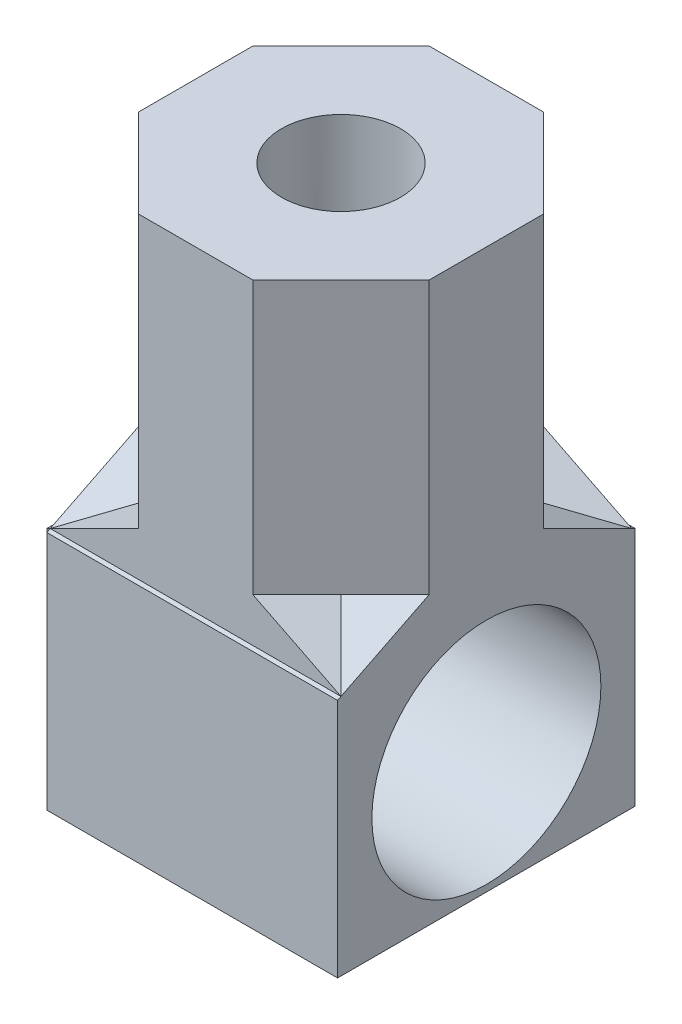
ISO-10303-21;
HEADER;
FILE_DESCRIPTION(('STEP AP214'),'2;1');
FILE_NAME('part.step','',(''),(''),'','','');
FILE_SCHEMA(('AUTOMOTIVE_DESIGN { 1 0 10303 214 1 1 1 1 }'));
ENDSEC;
DATA;
#1=APPLICATION_CONTEXT('core data for automotive mechanical design processes');
#2=APPLICATION_PROTOCOL_DEFINITION('international standard','automotive_design',2000,#1);
#3=PRODUCT_CONTEXT('',#1,'mechanical');
#4=PRODUCT('Part','Part','',(#3));
#5=PRODUCT_RELATED_PRODUCT_CATEGORY('part','',(#4));
#6=PRODUCT_DEFINITION_FORMATION('','',#4);
#7=PRODUCT_DEFINITION_CONTEXT('part definition',#1,'design');
#8=PRODUCT_DEFINITION('design','',#6,#7);
#9=PRODUCT_DEFINITION_SHAPE('','',#8);
#10=(LENGTH_UNIT() NAMED_UNIT(*) SI_UNIT(.MILLI.,.METRE.));
#11=(NAMED_UNIT(*) PLANE_ANGLE_UNIT() SI_UNIT($,.RADIAN.));
#12=(NAMED_UNIT(*) SI_UNIT($,.STERADIAN.) SOLID_ANGLE_UNIT());
#13=UNCERTAINTY_MEASURE_WITH_UNIT(LENGTH_MEASURE(1.E-05),#10,'distance_accuracy_value','');
#14=(GEOMETRIC_REPRESENTATION_CONTEXT(3) GLOBAL_UNCERTAINTY_ASSIGNED_CONTEXT((#13)) GLOBAL_UNIT_ASSIGNED_CONTEXT((#10,
#11,#12)) REPRESENTATION_CONTEXT('',''));
#15=CARTESIAN_POINT('',(0.,0.,0.));
#16=DIRECTION('',(0.,0.,1.));
#17=DIRECTION('',(1.,0.,0.));
#18=AXIS2_PLACEMENT_3D('',#15,#16,#17);
#19=CARTESIAN_POINT('',(-8.25499999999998,-15.494,8.06449999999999));
#20=DIRECTION('',(0.,-1.,0.));
#21=DIRECTION('',(0.,0.,-1.));
#22=AXIS2_PLACEMENT_3D('',#19,#20,#21);
#23=PLANE('',#22);
#24=DIRECTION('',(1.,0.,0.));
#25=VECTOR('',#24,1.);
#26=CARTESIAN_POINT('',(-8.25499999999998,-15.4939999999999,-8.255));
#27=LINE('',#26,#25);
#28=CARTESIAN_POINT('',(-8.06450000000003,-15.4939999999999,-8.255));
#29=VERTEX_POINT('',#28);
#30=CARTESIAN_POINT('',(8.06449999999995,-15.4939999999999,-8.255));
#31=VERTEX_POINT('',#30);
#32=EDGE_CURVE('E299',#29,#31,#27,.T.);
#33=ORIENTED_EDGE('',*,*,#32,.T.);
#34=DIRECTION('',(0.,0.,-1.));
#35=VECTOR('',#34,1.);
#36=CARTESIAN_POINT('',(8.06449999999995,-15.494,0.));
#37=LINE('',#36,#35);
#38=CARTESIAN_POINT('',(8.06449999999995,-15.494,8.255));
#39=VERTEX_POINT('',#38);
#40=EDGE_CURVE('E101',#39,#31,#37,.T.);
#41=ORIENTED_EDGE('',*,*,#40,.F.);
#42=DIRECTION('',(1.,0.,0.));
#43=VECTOR('',#42,1.);
#44=CARTESIAN_POINT('',(-8.25499999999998,-15.494,8.255));
#45=LINE('',#44,#43);
#46=CARTESIAN_POINT('',(-8.06450000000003,-15.494,8.255));
#47=VERTEX_POINT('',#46);
#48=EDGE_CURVE('E118',#39,#47,#45,.F.);
#49=ORIENTED_EDGE('',*,*,#48,.T.);
#50=DIRECTION('',(0.,0.,-1.));
#51=VECTOR('',#50,1.);
#52=CARTESIAN_POINT('',(-8.06450000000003,-15.494,8.06449999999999));
#53=LINE('',#52,#51);
#54=CARTESIAN_POINT('',(-8.06450000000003,-15.494,8.06449999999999));
#55=VERTEX_POINT('',#54);
#56=EDGE_CURVE('E308',#47,#55,#53,.T.);
#57=ORIENTED_EDGE('',*,*,#56,.T.);
#58=DIRECTION('',(1.,0.,0.));
#59=VECTOR('',#58,1.);
#60=CARTESIAN_POINT('',(-8.25499999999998,-15.494,8.06449999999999));
#61=LINE('',#60,#59);
#62=CARTESIAN_POINT('',(-8.25499999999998,-15.494,8.06449999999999));
#63=VERTEX_POINT('',#62);
#64=EDGE_CURVE('E306',#55,#63,#61,.F.);
#65=ORIENTED_EDGE('',*,*,#64,.T.);
#66=DIRECTION('',(0.,0.,1.));
#67=VECTOR('',#66,1.);
#68=CARTESIAN_POINT('',(-8.25499999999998,-15.494,8.06449999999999));
#69=LINE('',#68,#67);
#70=CARTESIAN_POINT('',(-8.25499999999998,-15.494,-8.06450000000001));
#71=VERTEX_POINT('',#70);
#72=EDGE_CURVE('E314',#71,#63,#69,.T.);
#73=ORIENTED_EDGE('',*,*,#72,.F.);
#74=DIRECTION('',(1.,0.,0.));
#75=VECTOR('',#74,1.);
#76=CARTESIAN_POINT('',(-8.25499999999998,-15.494,-8.06450000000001));
#77=LINE('',#76,#75);
#78=CARTESIAN_POINT('',(-8.06450000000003,-15.494,-8.06450000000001));
#79=VERTEX_POINT('',#78);
#80=EDGE_CURVE('E303',#71,#79,#77,.T.);
#81=ORIENTED_EDGE('',*,*,#80,.T.);
#82=DIRECTION('',(0.,0.,-1.));
#83=VECTOR('',#82,1.);
#84=CARTESIAN_POINT('',(-8.06450000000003,-15.494,8.06449999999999));
#85=LINE('',#84,#83);
#86=EDGE_CURVE('E301',#79,#29,#85,.T.);
#87=ORIENTED_EDGE('',*,*,#86,.T.);
#88=EDGE_LOOP('',(#33,#41,#49,#57,#65,#73,#81,#87));
#89=FACE_BOUND('',#88,.T.);
#90=ADVANCED_FACE('F33',(#89),#23,.T.);
#91=CARTESIAN_POINT('',(-4.90369930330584,0.381000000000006,4.90369930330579));
#92=DIRECTION('',(0.,1.,0.));
#93=DIRECTION('',(0.,0.,1.));
#94=AXIS2_PLACEMENT_3D('',#91,#92,#93);
#95=PLANE('',#94);
#96=DIRECTION('',(1.,0.,0.));
#97=VECTOR('',#96,1.);
#98=CARTESIAN_POINT('',(-8.06450000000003,0.381000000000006,3.17499999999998));
#99=LINE('',#98,#97);
#100=CARTESIAN_POINT('',(-3.17500000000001,0.380999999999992,3.17499999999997));
#101=VERTEX_POINT('',#100);
#102=CARTESIAN_POINT('',(-8.06450000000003,0.380999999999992,3.17500000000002));
#103=VERTEX_POINT('',#102);
#104=EDGE_CURVE('E404',#101,#103,#99,.F.);
#105=ORIENTED_EDGE('',*,*,#104,.F.);
#106=DIRECTION('',(0.,0.,1.));
#107=VECTOR('',#106,1.);
#108=CARTESIAN_POINT('',(-3.17500000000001,0.381000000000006,8.06449999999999));
#109=LINE('',#108,#107);
#110=CARTESIAN_POINT('',(-3.17500000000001,0.381000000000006,8.06449999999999));
#111=VERTEX_POINT('',#110);
#112=EDGE_CURVE('E400',#111,#101,#109,.F.);
#113=ORIENTED_EDGE('',*,*,#112,.F.);
#114=DIRECTION('',(0.707106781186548,0.,0.707106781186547));
#115=VECTOR('',#114,1.);
#116=CARTESIAN_POINT('',(-8.06450000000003,0.380999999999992,3.17500000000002));
#117=LINE('',#116,#115);
#118=EDGE_CURVE('E369',#103,#111,#117,.T.);
#119=ORIENTED_EDGE('',*,*,#118,.F.);
#120=EDGE_LOOP('',(#105,#113,#119));
#121=FACE_BOUND('',#120,.T.);
#122=ADVANCED_FACE('F346',(#121),#95,.F.);
#123=CARTESIAN_POINT('',(-3.17500000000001,0.381000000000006,8.06449999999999));
#124=DIRECTION('',(-0.447213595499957,0.894427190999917,0.));
#125=DIRECTION('',(-0.894427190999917,-0.447213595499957,0.));
#126=AXIS2_PLACEMENT_3D('',#123,#124,#125);
#127=PLANE('',#126);
#128=DIRECTION('',(0.,0.,1.));
#129=VECTOR('',#128,1.);
#130=CARTESIAN_POINT('',(-3.17500000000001,0.380999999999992,-4.90369930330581));
#131=LINE('',#130,#129);
#132=CARTESIAN_POINT('',(-3.17500000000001,0.381000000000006,-3.17500000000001));
#133=VERTEX_POINT('',#132);
#134=CARTESIAN_POINT('',(-3.17500000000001,0.380999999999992,-8.06450000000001));
#135=VERTEX_POINT('',#134);
#136=EDGE_CURVE('E516',#133,#135,#131,.F.);
#137=ORIENTED_EDGE('',*,*,#136,.T.);
#138=DIRECTION('',(0.894427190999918,0.447213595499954,0.));
#139=VECTOR('',#138,1.);
#140=CARTESIAN_POINT('',(-8.06450000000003,-2.06374999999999,-8.06450000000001));
#141=LINE('',#140,#139);
#142=CARTESIAN_POINT('',(-8.06450000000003,-2.06374999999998,-8.06450000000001));
#143=VERTEX_POINT('',#142);
#144=EDGE_CURVE('E368',#143,#135,#141,.T.);
#145=ORIENTED_EDGE('',*,*,#144,.F.);
#146=DIRECTION('',(-0.666666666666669,-0.333333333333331,-0.666666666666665));
#147=VECTOR('',#146,1.);
#148=CARTESIAN_POINT('',(-3.17500000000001,0.381000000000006,-3.17500000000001));
#149=LINE('',#148,#147);
#150=EDGE_CURVE('E517',#133,#143,#149,.T.);
#151=ORIENTED_EDGE('',*,*,#150,.F.);
#152=EDGE_LOOP('',(#137,#145,#151));
#153=FACE_BOUND('',#152,.T.);
#154=ADVANCED_FACE('F350',(#153),#127,.T.);
#155=CARTESIAN_POINT('',(-4.90369930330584,0.380999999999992,-4.90369930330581));
#156=DIRECTION('',(0.,1.,0.));
#157=DIRECTION('',(0.,0.,1.));
#158=AXIS2_PLACEMENT_3D('',#155,#156,#157);
#159=PLANE('',#158);
#160=ORIENTED_EDGE('',*,*,#136,.F.);
#161=DIRECTION('',(1.,0.,0.));
#162=VECTOR('',#161,1.);
#163=CARTESIAN_POINT('',(-8.06450000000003,0.381000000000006,-3.17500000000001));
#164=LINE('',#163,#162);
#165=CARTESIAN_POINT('',(-8.06450000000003,0.381000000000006,-3.17500000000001));
#166=VERTEX_POINT('',#165);
#167=EDGE_CURVE('E407',#166,#133,#164,.T.);
#168=ORIENTED_EDGE('',*,*,#167,.F.);
#169=DIRECTION('',(-0.707106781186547,0.,0.707106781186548));
#170=VECTOR('',#169,1.);
#171=CARTESIAN_POINT('',(-3.17500000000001,0.380999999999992,-8.06450000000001));
#172=LINE('',#171,#170);
#173=EDGE_CURVE('E381',#135,#166,#172,.T.);
#174=ORIENTED_EDGE('',*,*,#173,.F.);
#175=EDGE_LOOP('',(#160,#168,#174));
#176=FACE_BOUND('',#175,.T.);
#177=ADVANCED_FACE('F504',(#176),#159,.F.);
#178=CARTESIAN_POINT('',(-8.06450000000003,0.381000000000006,-3.17500000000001));
#179=DIRECTION('',(0.,0.894427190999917,-0.447213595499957));
#180=DIRECTION('',(0.,0.447213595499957,0.894427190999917));
#181=AXIS2_PLACEMENT_3D('',#178,#179,#180);
#182=PLANE('',#181);
#183=DIRECTION('',(0.,0.447213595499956,0.894427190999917));
#184=VECTOR('',#183,1.);
#185=CARTESIAN_POINT('',(-8.06450000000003,-2.06374999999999,-8.06450000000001));
#186=LINE('',#185,#184);
#187=EDGE_CURVE('E380',#143,#166,#186,.T.);
#188=ORIENTED_EDGE('',*,*,#187,.T.);
#189=ORIENTED_EDGE('',*,*,#167,.T.);
#190=ORIENTED_EDGE('',*,*,#150,.T.);
#191=EDGE_LOOP('',(#188,#189,#190));
#192=FACE_BOUND('',#191,.T.);
#193=ADVANCED_FACE('F501',(#192),#182,.T.);
#194=CARTESIAN_POINT('',(-8.06450000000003,-2.15899999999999,8.255));
#195=DIRECTION('',(0.,0.894427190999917,0.447213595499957));
#196=DIRECTION('',(0.,-0.447213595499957,0.894427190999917));
#197=AXIS2_PLACEMENT_3D('',#194,#195,#196);
#198=PLANE('',#197);
#199=ORIENTED_EDGE('',*,*,#104,.T.);
#200=DIRECTION('',(0.,-0.447213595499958,0.894427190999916));
#201=VECTOR('',#200,1.);
#202=CARTESIAN_POINT('',(-8.06450000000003,0.380999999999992,3.17500000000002));
#203=LINE('',#202,#201);
#204=CARTESIAN_POINT('',(-8.06450000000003,-2.06374999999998,8.06449999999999));
#205=VERTEX_POINT('',#204);
#206=EDGE_CURVE('E383',#103,#205,#203,.T.);
#207=ORIENTED_EDGE('',*,*,#206,.T.);
#208=DIRECTION('',(-0.666666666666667,-0.333333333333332,0.666666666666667));
#209=VECTOR('',#208,1.);
#210=CARTESIAN_POINT('',(-3.17500000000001,0.380999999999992,3.17499999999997));
#211=LINE('',#210,#209);
#212=EDGE_CURVE('E402',#101,#205,#211,.T.);
#213=ORIENTED_EDGE('',*,*,#212,.F.);
#214=EDGE_LOOP('',(#199,#207,#213));
#215=FACE_BOUND('',#214,.T.);
#216=ADVANCED_FACE('F498',(#215),#198,.T.);
#217=CARTESIAN_POINT('',(-3.17500000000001,0.381000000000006,8.06449999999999));
#218=DIRECTION('',(-0.447213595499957,0.894427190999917,0.));
#219=DIRECTION('',(-0.894427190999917,-0.447213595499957,0.));
#220=AXIS2_PLACEMENT_3D('',#217,#218,#219);
#221=PLANE('',#220);
#222=DIRECTION('',(0.894427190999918,0.447213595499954,0.));
#223=VECTOR('',#222,1.);
#224=CARTESIAN_POINT('',(-8.06450000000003,-2.06374999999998,8.06449999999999));
#225=LINE('',#224,#223);
#226=EDGE_CURVE('E221',#205,#111,#225,.T.);
#227=ORIENTED_EDGE('',*,*,#226,.T.);
#228=ORIENTED_EDGE('',*,*,#112,.T.);
#229=ORIENTED_EDGE('',*,*,#212,.T.);
#230=EDGE_LOOP('',(#227,#228,#229));
#231=FACE_BOUND('',#230,.T.);
#232=ADVANCED_FACE('F398',(#231),#221,.T.);
#233=CARTESIAN_POINT('',(-8.06450000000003,-2.15899999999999,8.255));
#234=DIRECTION('',(0.,0.894427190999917,0.447213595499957));
#235=DIRECTION('',(0.,-0.447213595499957,0.894427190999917));
#236=AXIS2_PLACEMENT_3D('',#233,#234,#235);
#237=PLANE('',#236);
#238=DIRECTION('',(1.,0.,0.));
#239=VECTOR('',#238,1.);
#240=CARTESIAN_POINT('',(-8.06450000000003,-2.15899999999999,8.255));
#241=LINE('',#240,#239);
#242=CARTESIAN_POINT('',(8.06449999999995,-2.15899999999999,8.255));
#243=VERTEX_POINT('',#242);
#244=CARTESIAN_POINT('',(-8.06450000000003,-2.15899999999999,8.255));
#245=VERTEX_POINT('',#244);
#246=EDGE_CURVE('E238',#243,#245,#241,.F.);
#247=ORIENTED_EDGE('',*,*,#246,.F.);
#248=DIRECTION('',(0.,-0.447213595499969,0.89442719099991));
#249=VECTOR('',#248,1.);
#250=CARTESIAN_POINT('',(8.06449999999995,-2.06374999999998,8.06449999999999));
#251=LINE('',#250,#249);
#252=CARTESIAN_POINT('',(8.06449999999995,-2.06374999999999,8.06449999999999));
#253=VERTEX_POINT('',#252);
#254=EDGE_CURVE('E205',#253,#243,#251,.T.);
#255=ORIENTED_EDGE('',*,*,#254,.F.);
#256=DIRECTION('',(-1.,0.,0.));
#257=VECTOR('',#256,1.);
#258=CARTESIAN_POINT('',(0.,-2.06374999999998,8.06449999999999));
#259=LINE('',#258,#257);
#260=EDGE_CURVE('E214',#253,#205,#259,.T.);
#261=ORIENTED_EDGE('',*,*,#260,.T.);
#262=DIRECTION('',(0.,-0.447213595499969,0.89442719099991));
#263=VECTOR('',#262,1.);
#264=CARTESIAN_POINT('',(-8.06450000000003,-2.06374999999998,8.06449999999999));
#265=LINE('',#264,#263);
#266=EDGE_CURVE('E244',#205,#245,#265,.T.);
#267=ORIENTED_EDGE('',*,*,#266,.T.);
#268=EDGE_LOOP('',(#247,#255,#261,#267));
#269=FACE_BOUND('',#268,.T.);
#270=ADVANCED_FACE('F237',(#269),#237,.T.);
#271=CARTESIAN_POINT('',(-8.06450000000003,0.381000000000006,-3.17500000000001));
#272=DIRECTION('',(0.,0.894427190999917,-0.447213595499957));
#273=DIRECTION('',(0.,0.447213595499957,0.894427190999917));
#274=AXIS2_PLACEMENT_3D('',#271,#272,#273);
#275=PLANE('',#274);
#276=DIRECTION('',(-1.,0.,0.));
#277=VECTOR('',#276,1.);
#278=CARTESIAN_POINT('',(-8.06450000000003,-2.15899999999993,-8.255));
#279=LINE('',#278,#277);
#280=CARTESIAN_POINT('',(-8.06450000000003,-2.15899999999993,-8.255));
#281=VERTEX_POINT('',#280);
#282=CARTESIAN_POINT('',(8.06449999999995,-2.15899999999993,-8.255));
#283=VERTEX_POINT('',#282);
#284=EDGE_CURVE('E253',#281,#283,#279,.F.);
#285=ORIENTED_EDGE('',*,*,#284,.F.);
#286=DIRECTION('',(0.,0.447213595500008,0.894427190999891));
#287=VECTOR('',#286,1.);
#288=CARTESIAN_POINT('',(-8.06450000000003,-2.15899999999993,-8.255));
#289=LINE('',#288,#287);
#290=EDGE_CURVE('E248',#281,#143,#289,.T.);
#291=ORIENTED_EDGE('',*,*,#290,.T.);
#292=DIRECTION('',(-1.,0.,0.));
#293=VECTOR('',#292,1.);
#294=CARTESIAN_POINT('',(0.,-2.06374999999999,-8.06450000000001));
#295=LINE('',#294,#293);
#296=CARTESIAN_POINT('',(8.06449999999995,-2.06374999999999,-8.06450000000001));
#297=VERTEX_POINT('',#296);
#298=EDGE_CURVE('E365',#297,#143,#295,.T.);
#299=ORIENTED_EDGE('',*,*,#298,.F.);
#300=DIRECTION('',(0.,0.447213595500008,0.894427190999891));
#301=VECTOR('',#300,1.);
#302=CARTESIAN_POINT('',(8.06449999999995,-2.15899999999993,-8.255));
#303=LINE('',#302,#301);
#304=EDGE_CURVE('E258',#283,#297,#303,.T.);
#305=ORIENTED_EDGE('',*,*,#304,.F.);
#306=EDGE_LOOP('',(#285,#291,#299,#305));
#307=FACE_BOUND('',#306,.T.);
#308=ADVANCED_FACE('F363',(#307),#275,.T.);
#309=CARTESIAN_POINT('',(8.25499999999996,-2.15899999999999,8.06449999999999));
#310=DIRECTION('',(0.447213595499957,0.894427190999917,0.));
#311=DIRECTION('',(-0.894427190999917,0.447213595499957,0.));
#312=AXIS2_PLACEMENT_3D('',#309,#310,#311);
#313=PLANE('',#312);
#314=DIRECTION('',(0.894427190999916,-0.447213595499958,0.));
#315=VECTOR('',#314,1.);
#316=CARTESIAN_POINT('',(3.17499999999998,0.381000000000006,-8.06450000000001));
#317=LINE('',#316,#315);
#318=CARTESIAN_POINT('',(3.17499999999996,0.380999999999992,-8.06449999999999));
#319=VERTEX_POINT('',#318);
#320=EDGE_CURVE('E371',#319,#297,#317,.T.);
#321=ORIENTED_EDGE('',*,*,#320,.F.);
#322=DIRECTION('',(0.,0.,1.));
#323=VECTOR('',#322,1.);
#324=CARTESIAN_POINT('',(3.17499999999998,0.380999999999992,-4.90369930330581));
#325=LINE('',#324,#323);
#326=CARTESIAN_POINT('',(3.17499999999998,0.381000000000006,-3.17500000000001));
#327=VERTEX_POINT('',#326);
#328=EDGE_CURVE('E373',#319,#327,#325,.T.);
#329=ORIENTED_EDGE('',*,*,#328,.T.);
#330=DIRECTION('',(-0.666666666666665,0.333333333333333,0.666666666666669));
#331=VECTOR('',#330,1.);
#332=CARTESIAN_POINT('',(8.06449999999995,-2.06374999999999,-8.06450000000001));
#333=LINE('',#332,#331);
#334=EDGE_CURVE('E270',#297,#327,#333,.T.);
#335=ORIENTED_EDGE('',*,*,#334,.F.);
#336=EDGE_LOOP('',(#321,#329,#335));
#337=FACE_BOUND('',#336,.T.);
#338=ADVANCED_FACE('F421',(#337),#313,.T.);
#339=CARTESIAN_POINT('',(4.90369930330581,0.380999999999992,-4.90369930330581));
#340=DIRECTION('',(0.,1.,0.));
#341=DIRECTION('',(0.,0.,1.));
#342=AXIS2_PLACEMENT_3D('',#339,#340,#341);
#343=PLANE('',#342);
#344=DIRECTION('',(1.,0.,0.));
#345=VECTOR('',#344,1.);
#346=CARTESIAN_POINT('',(-8.06450000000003,0.381000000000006,-3.17500000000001));
#347=LINE('',#346,#345);
#348=CARTESIAN_POINT('',(8.06449999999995,0.381000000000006,-3.17500000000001));
#349=VERTEX_POINT('',#348);
#350=EDGE_CURVE('E273',#327,#349,#347,.T.);
#351=ORIENTED_EDGE('',*,*,#350,.F.);
#352=ORIENTED_EDGE('',*,*,#328,.F.);
#353=DIRECTION('',(-0.707106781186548,0.,-0.707106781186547));
#354=VECTOR('',#353,1.);
#355=CARTESIAN_POINT('',(8.06449999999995,0.381000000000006,-3.17500000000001));
#356=LINE('',#355,#354);
#357=EDGE_CURVE('E275',#349,#319,#356,.T.);
#358=ORIENTED_EDGE('',*,*,#357,.F.);
#359=EDGE_LOOP('',(#351,#352,#358));
#360=FACE_BOUND('',#359,.T.);
#361=ADVANCED_FACE('F423',(#360),#343,.F.);
#362=CARTESIAN_POINT('',(-8.06450000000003,15.494,3.17500000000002));
#363=DIRECTION('',(-0.707106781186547,0.,0.707106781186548));
#364=DIRECTION('',(0.707106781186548,0.,0.707106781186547));
#365=AXIS2_PLACEMENT_3D('',#362,#363,#364);
#366=PLANE('',#365);
#367=DIRECTION('',(0.707106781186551,0.,0.707106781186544));
#368=VECTOR('',#367,1.);
#369=CARTESIAN_POINT('',(-8.06450000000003,15.494,3.17500000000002));
#370=LINE('',#369,#368);
#371=CARTESIAN_POINT('',(-8.06450000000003,15.494,3.17500000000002));
#372=VERTEX_POINT('',#371);
#373=CARTESIAN_POINT('',(-3.17500000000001,15.494,8.0645));
#374=VERTEX_POINT('',#373);
#375=EDGE_CURVE('E279',#372,#374,#370,.T.);
#376=ORIENTED_EDGE('',*,*,#375,.F.);
#377=DIRECTION('',(0.,1.,0.));
#378=VECTOR('',#377,1.);
#379=CARTESIAN_POINT('',(-8.06450000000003,-1.78895756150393,3.17500000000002));
#380=LINE('',#379,#378);
#381=EDGE_CURVE('E386',#372,#103,#380,.F.);
#382=ORIENTED_EDGE('',*,*,#381,.T.);
#383=ORIENTED_EDGE('',*,*,#118,.T.);
#384=DIRECTION('',(0.,1.,0.));
#385=VECTOR('',#384,1.);
#386=CARTESIAN_POINT('',(-3.17500000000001,-1.78895756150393,8.06449999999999));
#387=LINE('',#386,#385);
#388=EDGE_CURVE('E225',#111,#374,#387,.T.);
#389=ORIENTED_EDGE('',*,*,#388,.T.);
#390=EDGE_LOOP('',(#376,#382,#383,#389));
#391=FACE_BOUND('',#390,.T.);
#392=ADVANCED_FACE('F484',(#391),#366,.T.);
#393=CARTESIAN_POINT('',(0.,-1.78895756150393,-8.06450000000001));
#394=DIRECTION('',(0.,0.,-1.));
#395=DIRECTION('',(-1.,0.,0.));
#396=AXIS2_PLACEMENT_3D('',#393,#394,#395);
#397=PLANE('',#396);
#398=DIRECTION('',(0.,1.,0.));
#399=VECTOR('',#398,1.);
#400=CARTESIAN_POINT('',(3.17499999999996,15.494,-8.06449999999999));
#401=LINE('',#400,#399);
#402=CARTESIAN_POINT('',(3.17499999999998,15.494,-8.06450000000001));
#403=VERTEX_POINT('',#402);
#404=EDGE_CURVE('E277',#319,#403,#401,.T.);
#405=ORIENTED_EDGE('',*,*,#404,.F.);
#406=ORIENTED_EDGE('',*,*,#320,.T.);
#407=ORIENTED_EDGE('',*,*,#298,.T.);
#408=ORIENTED_EDGE('',*,*,#144,.T.);
#409=DIRECTION('',(0.,1.,0.));
#410=VECTOR('',#409,1.);
#411=CARTESIAN_POINT('',(-3.17500000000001,15.494,-8.06450000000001));
#412=LINE('',#411,#410);
#413=CARTESIAN_POINT('',(-3.17500000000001,15.494,-8.06450000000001));
#414=VERTEX_POINT('',#413);
#415=EDGE_CURVE('E377',#414,#135,#412,.F.);
#416=ORIENTED_EDGE('',*,*,#415,.F.);
#417=DIRECTION('',(1.,0.,0.));
#418=VECTOR('',#417,1.);
#419=CARTESIAN_POINT('',(4.90369930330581,15.494,-8.06450000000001));
#420=LINE('',#419,#418);
#421=EDGE_CURVE('E287',#403,#414,#420,.F.);
#422=ORIENTED_EDGE('',*,*,#421,.F.);
#423=EDGE_LOOP('',(#405,#406,#407,#408,#416,#422));
#424=FACE_BOUND('',#423,.T.);
#425=ADVANCED_FACE('F413',(#424),#397,.T.);
#426=CARTESIAN_POINT('',(-3.17500000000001,15.494,-8.06450000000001));
#427=DIRECTION('',(-0.707106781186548,0.,-0.707106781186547));
#428=DIRECTION('',(-0.707106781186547,0.,0.707106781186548));
#429=AXIS2_PLACEMENT_3D('',#426,#427,#428);
#430=PLANE('',#429);
#431=DIRECTION('',(-0.70710678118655,0.,0.707106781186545));
#432=VECTOR('',#431,1.);
#433=CARTESIAN_POINT('',(-3.17500000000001,15.494,-8.06450000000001));
#434=LINE('',#433,#432);
#435=CARTESIAN_POINT('',(-8.06450000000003,15.494,-3.17500000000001));
#436=VERTEX_POINT('',#435);
#437=EDGE_CURVE('E285',#414,#436,#434,.T.);
#438=ORIENTED_EDGE('',*,*,#437,.F.);
#439=ORIENTED_EDGE('',*,*,#415,.T.);
#440=ORIENTED_EDGE('',*,*,#173,.T.);
#441=DIRECTION('',(0.,1.,0.));
#442=VECTOR('',#441,1.);
#443=CARTESIAN_POINT('',(-8.06450000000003,-1.78895756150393,-3.17500000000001));
#444=LINE('',#443,#442);
#445=EDGE_CURVE('E389',#166,#436,#444,.T.);
#446=ORIENTED_EDGE('',*,*,#445,.T.);
#447=EDGE_LOOP('',(#438,#439,#440,#446));
#448=FACE_BOUND('',#447,.T.);
#449=ADVANCED_FACE('F477',(#448),#430,.T.);
#450=CARTESIAN_POINT('',(-8.06450000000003,-1.78895756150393,0.));
#451=DIRECTION('',(1.,0.,0.));
#452=DIRECTION('',(0.,0.,-1.));
#453=AXIS2_PLACEMENT_3D('',#450,#451,#452);
#454=PLANE('',#453);
#455=ORIENTED_EDGE('',*,*,#206,.F.);
#456=ORIENTED_EDGE('',*,*,#381,.F.);
#457=DIRECTION('',(0.,0.,1.));
#458=VECTOR('',#457,1.);
#459=CARTESIAN_POINT('',(-8.06450000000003,15.494,4.90369930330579));
#460=LINE('',#459,#458);
#461=EDGE_CURVE('E282',#436,#372,#460,.T.);
#462=ORIENTED_EDGE('',*,*,#461,.F.);
#463=ORIENTED_EDGE('',*,*,#445,.F.);
#464=ORIENTED_EDGE('',*,*,#187,.F.);
#465=DIRECTION('',(0.,0.,1.));
#466=VECTOR('',#465,1.);
#467=CARTESIAN_POINT('',(-8.06450000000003,-2.06375,8.06449999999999));
#468=LINE('',#467,#466);
#469=EDGE_CURVE('E266',#205,#143,#468,.F.);
#470=ORIENTED_EDGE('',*,*,#469,.F.);
#471=EDGE_LOOP('',(#455,#456,#462,#463,#464,#470));
#472=FACE_BOUND('',#471,.T.);
#473=ADVANCED_FACE('F474',(#472),#454,.F.);
#474=CARTESIAN_POINT('',(0.,-1.78895756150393,8.06449999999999));
#475=DIRECTION('',(0.,0.,-1.));
#476=DIRECTION('',(-1.,0.,0.));
#477=AXIS2_PLACEMENT_3D('',#474,#475,#476);
#478=PLANE('',#477);
#479=DIRECTION('',(-0.894427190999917,0.447213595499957,0.));
#480=VECTOR('',#479,1.);
#481=CARTESIAN_POINT('',(8.25499999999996,-2.15899999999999,8.06449999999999));
#482=LINE('',#481,#480);
#483=CARTESIAN_POINT('',(3.17499999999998,0.381000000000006,8.06449999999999));
#484=VERTEX_POINT('',#483);
#485=EDGE_CURVE('E218',#484,#253,#482,.F.);
#486=ORIENTED_EDGE('',*,*,#485,.F.);
#487=DIRECTION('',(0.,1.,0.));
#488=VECTOR('',#487,1.);
#489=CARTESIAN_POINT('',(3.17499999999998,15.494,8.0645));
#490=LINE('',#489,#488);
#491=CARTESIAN_POINT('',(3.17499999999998,15.494,8.0645));
#492=VERTEX_POINT('',#491);
#493=EDGE_CURVE('E234',#492,#484,#490,.F.);
#494=ORIENTED_EDGE('',*,*,#493,.F.);
#495=DIRECTION('',(1.,0.,0.));
#496=VECTOR('',#495,1.);
#497=CARTESIAN_POINT('',(4.90369930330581,15.494,8.0645));
#498=LINE('',#497,#496);
#499=EDGE_CURVE('E134',#374,#492,#498,.T.);
#500=ORIENTED_EDGE('',*,*,#499,.F.);
#501=ORIENTED_EDGE('',*,*,#388,.F.);
#502=ORIENTED_EDGE('',*,*,#226,.F.);
#503=ORIENTED_EDGE('',*,*,#260,.F.);
#504=EDGE_LOOP('',(#486,#494,#500,#501,#502,#503));
#505=FACE_BOUND('',#504,.T.);
#506=ADVANCED_FACE('F216',(#505),#478,.F.);
#507=CARTESIAN_POINT('',(8.25499999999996,-2.15899999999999,8.06449999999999));
#508=DIRECTION('',(0.447213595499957,0.894427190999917,0.));
#509=DIRECTION('',(-0.894427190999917,0.447213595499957,0.));
#510=AXIS2_PLACEMENT_3D('',#507,#508,#509);
#511=PLANE('',#510);
#512=DIRECTION('',(0.,0.,1.));
#513=VECTOR('',#512,1.);
#514=CARTESIAN_POINT('',(3.17499999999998,0.381000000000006,4.90369930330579));
#515=LINE('',#514,#513);
#516=CARTESIAN_POINT('',(3.17499999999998,0.381000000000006,3.17499999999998));
#517=VERTEX_POINT('',#516);
#518=EDGE_CURVE('E125',#517,#484,#515,.T.);
#519=ORIENTED_EDGE('',*,*,#518,.T.);
#520=ORIENTED_EDGE('',*,*,#485,.T.);
#521=DIRECTION('',(0.666666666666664,-0.333333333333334,0.66666666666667));
#522=VECTOR('',#521,1.);
#523=CARTESIAN_POINT('',(3.17499999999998,0.381000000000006,3.17499999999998));
#524=LINE('',#523,#522);
#525=EDGE_CURVE('E230',#517,#253,#524,.T.);
#526=ORIENTED_EDGE('',*,*,#525,.F.);
#527=EDGE_LOOP('',(#519,#520,#526));
#528=FACE_BOUND('',#527,.T.);
#529=ADVANCED_FACE('F229',(#528),#511,.T.);
#530=CARTESIAN_POINT('',(4.90369930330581,0.381000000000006,4.90369930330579));
#531=DIRECTION('',(0.,1.,0.));
#532=DIRECTION('',(0.,0.,1.));
#533=AXIS2_PLACEMENT_3D('',#530,#531,#532);
#534=PLANE('',#533);
#535=ORIENTED_EDGE('',*,*,#518,.F.);
#536=DIRECTION('',(1.,0.,0.));
#537=VECTOR('',#536,1.);
#538=CARTESIAN_POINT('',(-8.06450000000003,0.381000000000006,3.17499999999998));
#539=LINE('',#538,#537);
#540=CARTESIAN_POINT('',(8.06449999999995,0.380999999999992,3.17499999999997));
#541=VERTEX_POINT('',#540);
#542=EDGE_CURVE('E233',#541,#517,#539,.F.);
#543=ORIENTED_EDGE('',*,*,#542,.F.);
#544=DIRECTION('',(0.707106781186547,0.,-0.707106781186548));
#545=VECTOR('',#544,1.);
#546=CARTESIAN_POINT('',(3.17499999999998,0.381000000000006,8.06449999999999));
#547=LINE('',#546,#545);
#548=EDGE_CURVE('E53',#484,#541,#547,.T.);
#549=ORIENTED_EDGE('',*,*,#548,.F.);
#550=EDGE_LOOP('',(#535,#543,#549));
#551=FACE_BOUND('',#550,.T.);
#552=ADVANCED_FACE('F466',(#551),#534,.F.);
#553=CARTESIAN_POINT('',(-8.06450000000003,-14.351,8.255));
#554=DIRECTION('',(0.,0.,1.));
#555=DIRECTION('',(1.,0.,0.));
#556=AXIS2_PLACEMENT_3D('',#553,#554,#555);
#557=PLANE('',#556);
#558=DIRECTION('',(0.,1.,0.));
#559=VECTOR('',#558,1.);
#560=CARTESIAN_POINT('',(-8.06450000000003,-1.78895756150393,8.255));
#561=LINE('',#560,#559);
#562=EDGE_CURVE('E246',#245,#47,#561,.F.);
#563=ORIENTED_EDGE('',*,*,#562,.T.);
#564=ORIENTED_EDGE('',*,*,#48,.F.);
#565=DIRECTION('',(0.,1.,0.));
#566=VECTOR('',#565,1.);
#567=CARTESIAN_POINT('',(8.06449999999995,-14.351,8.255));
#568=LINE('',#567,#566);
#569=EDGE_CURVE('E239',#39,#243,#568,.T.);
#570=ORIENTED_EDGE('',*,*,#569,.T.);
#571=ORIENTED_EDGE('',*,*,#246,.T.);
#572=EDGE_LOOP('',(#563,#564,#570,#571));
#573=FACE_BOUND('',#572,.T.);
#574=ADVANCED_FACE('F462',(#573),#557,.T.);
#575=CARTESIAN_POINT('',(-8.06450000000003,-1.78895756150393,0.));
#576=DIRECTION('',(1.,0.,0.));
#577=DIRECTION('',(0.,0.,-1.));
#578=AXIS2_PLACEMENT_3D('',#575,#576,#577);
#579=PLANE('',#578);
#580=ORIENTED_EDGE('',*,*,#56,.F.);
#581=ORIENTED_EDGE('',*,*,#562,.F.);
#582=ORIENTED_EDGE('',*,*,#266,.F.);
#583=DIRECTION('',(0.,1.,0.));
#584=VECTOR('',#583,1.);
#585=CARTESIAN_POINT('',(-8.06450000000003,-1.78895756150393,8.06449999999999));
#586=LINE('',#585,#584);
#587=EDGE_CURVE('E263',#205,#55,#586,.F.);
#588=ORIENTED_EDGE('',*,*,#587,.T.);
#589=EDGE_LOOP('',(#580,#581,#582,#588));
#590=FACE_BOUND('',#589,.T.);
#591=ADVANCED_FACE('F458',(#590),#579,.F.);
#592=CARTESIAN_POINT('',(-8.06450000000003,-1.78895756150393,0.));
#593=DIRECTION('',(1.,0.,0.));
#594=DIRECTION('',(0.,0.,-1.));
#595=AXIS2_PLACEMENT_3D('',#592,#593,#594);
#596=PLANE('',#595);
#597=ORIENTED_EDGE('',*,*,#290,.F.);
#598=DIRECTION('',(0.,1.,0.));
#599=VECTOR('',#598,1.);
#600=CARTESIAN_POINT('',(-8.06450000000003,-14.3509999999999,-8.255));
#601=LINE('',#600,#599);
#602=EDGE_CURVE('E252',#29,#281,#601,.T.);
#603=ORIENTED_EDGE('',*,*,#602,.F.);
#604=ORIENTED_EDGE('',*,*,#86,.F.);
#605=DIRECTION('',(0.,1.,0.));
#606=VECTOR('',#605,1.);
#607=CARTESIAN_POINT('',(-8.06450000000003,-1.78895756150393,-8.06450000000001));
#608=LINE('',#607,#606);
#609=EDGE_CURVE('E260',#143,#79,#608,.F.);
#610=ORIENTED_EDGE('',*,*,#609,.F.);
#611=EDGE_LOOP('',(#597,#603,#604,#610));
#612=FACE_BOUND('',#611,.T.);
#613=ADVANCED_FACE('F455',(#612),#596,.F.);
#614=CARTESIAN_POINT('',(-8.06450000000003,-14.3509999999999,-8.255));
#615=DIRECTION('',(0.,0.,-1.));
#616=DIRECTION('',(-1.,0.,0.));
#617=AXIS2_PLACEMENT_3D('',#614,#615,#616);
#618=PLANE('',#617);
#619=ORIENTED_EDGE('',*,*,#602,.T.);
#620=ORIENTED_EDGE('',*,*,#284,.T.);
#621=DIRECTION('',(0.,1.,0.));
#622=VECTOR('',#621,1.);
#623=CARTESIAN_POINT('',(8.06449999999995,-1.78895756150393,-8.255));
#624=LINE('',#623,#622);
#625=EDGE_CURVE('E255',#31,#283,#624,.T.);
#626=ORIENTED_EDGE('',*,*,#625,.F.);
#627=ORIENTED_EDGE('',*,*,#32,.F.);
#628=EDGE_LOOP('',(#619,#620,#626,#627));
#629=FACE_BOUND('',#628,.T.);
#630=ADVANCED_FACE('F358',(#629),#618,.T.);
#631=CARTESIAN_POINT('',(0.,-1.78895756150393,-8.06450000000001));
#632=DIRECTION('',(0.,0.,-1.));
#633=DIRECTION('',(-1.,0.,0.));
#634=AXIS2_PLACEMENT_3D('',#631,#632,#633);
#635=PLANE('',#634);
#636=DIRECTION('',(0.,1.,0.));
#637=VECTOR('',#636,1.);
#638=CARTESIAN_POINT('',(-8.25499999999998,-14.351,-8.06450000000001));
#639=LINE('',#638,#637);
#640=CARTESIAN_POINT('',(-8.25499999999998,-2.15899999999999,-8.06450000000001));
#641=VERTEX_POINT('',#640);
#642=EDGE_CURVE('E316',#641,#71,#639,.F.);
#643=ORIENTED_EDGE('',*,*,#642,.F.);
#644=DIRECTION('',(-0.894427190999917,-0.447213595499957,0.));
#645=VECTOR('',#644,1.);
#646=CARTESIAN_POINT('',(-3.17500000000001,0.381000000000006,-8.06450000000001));
#647=LINE('',#646,#645);
#648=EDGE_CURVE('E93',#143,#641,#647,.T.);
#649=ORIENTED_EDGE('',*,*,#648,.F.);
#650=ORIENTED_EDGE('',*,*,#609,.T.);
#651=ORIENTED_EDGE('',*,*,#80,.F.);
#652=EDGE_LOOP('',(#643,#649,#650,#651));
#653=FACE_BOUND('',#652,.T.);
#654=ADVANCED_FACE('F448',(#653),#635,.T.);
#655=CARTESIAN_POINT('',(0.,-1.78895756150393,8.06449999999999));
#656=DIRECTION('',(0.,0.,-1.));
#657=DIRECTION('',(-1.,0.,0.));
#658=AXIS2_PLACEMENT_3D('',#655,#656,#657);
#659=PLANE('',#658);
#660=DIRECTION('',(-0.894427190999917,-0.447213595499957,0.));
#661=VECTOR('',#660,1.);
#662=CARTESIAN_POINT('',(-3.17500000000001,0.381000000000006,8.06449999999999));
#663=LINE('',#662,#661);
#664=CARTESIAN_POINT('',(-8.25499999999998,-2.15899999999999,8.06449999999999));
#665=VERTEX_POINT('',#664);
#666=EDGE_CURVE('E267',#665,#205,#663,.F.);
#667=ORIENTED_EDGE('',*,*,#666,.F.);
#668=DIRECTION('',(0.,1.,0.));
#669=VECTOR('',#668,1.);
#670=CARTESIAN_POINT('',(-8.25499999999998,-14.351,8.0645));
#671=LINE('',#670,#669);
#672=EDGE_CURVE('E79',#63,#665,#671,.T.);
#673=ORIENTED_EDGE('',*,*,#672,.F.);
#674=ORIENTED_EDGE('',*,*,#64,.F.);
#675=ORIENTED_EDGE('',*,*,#587,.F.);
#676=EDGE_LOOP('',(#667,#673,#674,#675));
#677=FACE_BOUND('',#676,.T.);
#678=ADVANCED_FACE('F445',(#677),#659,.F.);
#679=CARTESIAN_POINT('',(-3.17500000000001,0.381000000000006,8.06449999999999));
#680=DIRECTION('',(-0.447213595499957,0.894427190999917,0.));
#681=DIRECTION('',(-0.894427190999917,-0.447213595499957,0.));
#682=AXIS2_PLACEMENT_3D('',#679,#680,#681);
#683=PLANE('',#682);
#684=DIRECTION('',(0.,0.,1.));
#685=VECTOR('',#684,1.);
#686=CARTESIAN_POINT('',(-8.25499999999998,-2.15899999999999,8.06449999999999));
#687=LINE('',#686,#685);
#688=EDGE_CURVE('E311',#665,#641,#687,.F.);
#689=ORIENTED_EDGE('',*,*,#688,.F.);
#690=ORIENTED_EDGE('',*,*,#666,.T.);
#691=ORIENTED_EDGE('',*,*,#469,.T.);
#692=ORIENTED_EDGE('',*,*,#648,.T.);
#693=EDGE_LOOP('',(#689,#690,#691,#692));
#694=FACE_BOUND('',#693,.T.);
#695=ADVANCED_FACE('F442',(#694),#683,.T.);
#696=CARTESIAN_POINT('',(-8.06450000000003,0.381000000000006,-3.17500000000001));
#697=DIRECTION('',(0.,0.894427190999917,-0.447213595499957));
#698=DIRECTION('',(0.,0.447213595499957,0.894427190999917));
#699=AXIS2_PLACEMENT_3D('',#696,#697,#698);
#700=PLANE('',#699);
#701=ORIENTED_EDGE('',*,*,#350,.T.);
#702=DIRECTION('',(0.,0.447213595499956,0.894427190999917));
#703=VECTOR('',#702,1.);
#704=CARTESIAN_POINT('',(8.06449999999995,-2.06374999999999,-8.06450000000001));
#705=LINE('',#704,#703);
#706=EDGE_CURVE('E70',#297,#349,#705,.T.);
#707=ORIENTED_EDGE('',*,*,#706,.F.);
#708=ORIENTED_EDGE('',*,*,#334,.T.);
#709=EDGE_LOOP('',(#701,#707,#708));
#710=FACE_BOUND('',#709,.T.);
#711=ADVANCED_FACE('F418',(#710),#700,.T.);
#712=CARTESIAN_POINT('',(8.06449999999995,15.494,-3.17500000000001));
#713=DIRECTION('',(0.707106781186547,0.,-0.707106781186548));
#714=DIRECTION('',(-0.707106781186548,0.,-0.707106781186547));
#715=AXIS2_PLACEMENT_3D('',#712,#713,#714);
#716=PLANE('',#715);
#717=DIRECTION('',(-0.707106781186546,0.,-0.707106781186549));
#718=VECTOR('',#717,1.);
#719=CARTESIAN_POINT('',(8.06449999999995,15.494,-3.17500000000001));
#720=LINE('',#719,#718);
#721=CARTESIAN_POINT('',(8.06449999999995,15.494,-3.17500000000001));
#722=VERTEX_POINT('',#721);
#723=EDGE_CURVE('E289',#722,#403,#720,.T.);
#724=ORIENTED_EDGE('',*,*,#723,.F.);
#725=DIRECTION('',(0.,1.,0.));
#726=VECTOR('',#725,1.);
#727=CARTESIAN_POINT('',(8.06449999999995,-1.78895756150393,-3.17500000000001));
#728=LINE('',#727,#726);
#729=EDGE_CURVE('E65',#349,#722,#728,.T.);
#730=ORIENTED_EDGE('',*,*,#729,.F.);
#731=ORIENTED_EDGE('',*,*,#357,.T.);
#732=ORIENTED_EDGE('',*,*,#404,.T.);
#733=EDGE_LOOP('',(#724,#730,#731,#732));
#734=FACE_BOUND('',#733,.T.);
#735=ADVANCED_FACE('F425',(#734),#716,.T.);
#736=CARTESIAN_POINT('',(4.90369930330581,15.494,4.90369930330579));
#737=DIRECTION('',(0.,1.,0.));
#738=DIRECTION('',(0.,0.,1.));
#739=AXIS2_PLACEMENT_3D('',#736,#737,#738);
#740=PLANE('',#739);
#741=CARTESIAN_POINT('',(0.,15.494,0.));
#742=DIRECTION('',(0.,-1.,0.));
#743=DIRECTION('',(0.,0.,-1.));
#744=AXIS2_PLACEMENT_3D('',#741,#742,#743);
#745=CIRCLE('',#744,3.302);
#746=CARTESIAN_POINT('',(0.,15.494,-3.30199999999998));
#747=VERTEX_POINT('',#746);
#748=EDGE_CURVE('E38',#747,#747,#745,.T.);
#749=ORIENTED_EDGE('',*,*,#748,.T.);
#750=EDGE_LOOP('',(#749));
#751=FACE_BOUND('',#750,.T.);
#752=ORIENTED_EDGE('',*,*,#437,.T.);
#753=ORIENTED_EDGE('',*,*,#461,.T.);
#754=ORIENTED_EDGE('',*,*,#375,.T.);
#755=ORIENTED_EDGE('',*,*,#499,.T.);
#756=DIRECTION('',(0.707106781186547,0.,-0.707106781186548));
#757=VECTOR('',#756,1.);
#758=CARTESIAN_POINT('',(3.17499999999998,15.494,8.0645));
#759=LINE('',#758,#757);
#760=CARTESIAN_POINT('',(8.06449999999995,15.494,3.17499999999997));
#761=VERTEX_POINT('',#760);
#762=EDGE_CURVE('E295',#761,#492,#759,.F.);
#763=ORIENTED_EDGE('',*,*,#762,.F.);
#764=DIRECTION('',(0.,0.,-1.));
#765=VECTOR('',#764,1.);
#766=CARTESIAN_POINT('',(8.06449999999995,15.494,0.));
#767=LINE('',#766,#765);
#768=EDGE_CURVE('E321',#722,#761,#767,.F.);
#769=ORIENTED_EDGE('',*,*,#768,.F.);
#770=ORIENTED_EDGE('',*,*,#723,.T.);
#771=ORIENTED_EDGE('',*,*,#421,.T.);
#772=EDGE_LOOP('',(#752,#753,#754,#755,#763,#769,#770,#771));
#773=FACE_BOUND('',#772,.T.);
#774=ADVANCED_FACE('F427',(#751,#773),#740,.T.);
#775=CARTESIAN_POINT('',(3.17499999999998,15.494,8.0645));
#776=DIRECTION('',(0.707106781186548,0.,0.707106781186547));
#777=DIRECTION('',(0.707106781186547,0.,-0.707106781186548));
#778=AXIS2_PLACEMENT_3D('',#775,#776,#777);
#779=PLANE('',#778);
#780=ORIENTED_EDGE('',*,*,#762,.T.);
#781=ORIENTED_EDGE('',*,*,#493,.T.);
#782=ORIENTED_EDGE('',*,*,#548,.T.);
#783=DIRECTION('',(0.,1.,0.));
#784=VECTOR('',#783,1.);
#785=CARTESIAN_POINT('',(8.06449999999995,-1.78895756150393,3.17499999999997));
#786=LINE('',#785,#784);
#787=EDGE_CURVE('E207',#761,#541,#786,.F.);
#788=ORIENTED_EDGE('',*,*,#787,.F.);
#789=EDGE_LOOP('',(#780,#781,#782,#788));
#790=FACE_BOUND('',#789,.T.);
#791=ADVANCED_FACE('F428',(#790),#779,.T.);
#792=CARTESIAN_POINT('',(-8.06450000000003,-2.15899999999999,8.255));
#793=DIRECTION('',(0.,0.894427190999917,0.447213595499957));
#794=DIRECTION('',(0.,-0.447213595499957,0.894427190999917));
#795=AXIS2_PLACEMENT_3D('',#792,#793,#794);
#796=PLANE('',#795);
#797=DIRECTION('',(0.,-0.447213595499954,0.894427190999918));
#798=VECTOR('',#797,1.);
#799=CARTESIAN_POINT('',(8.06449999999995,0.380999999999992,3.17499999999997));
#800=LINE('',#799,#798);
#801=EDGE_CURVE('E200',#541,#253,#800,.T.);
#802=ORIENTED_EDGE('',*,*,#801,.F.);
#803=ORIENTED_EDGE('',*,*,#542,.T.);
#804=ORIENTED_EDGE('',*,*,#525,.T.);
#805=EDGE_LOOP('',(#802,#803,#804));
#806=FACE_BOUND('',#805,.T.);
#807=ADVANCED_FACE('F232',(#806),#796,.T.);
#808=CARTESIAN_POINT('',(0.,15.494,0.));
#809=DIRECTION('',(0.,-1.,0.));
#810=DIRECTION('',(0.,0.,-1.));
#811=AXIS2_PLACEMENT_3D('',#808,#809,#810);
#812=CYLINDRICAL_SURFACE('',#811,3.302);
#813=ORIENTED_EDGE('',*,*,#748,.F.);
#814=EDGE_LOOP('',(#813));
#815=FACE_BOUND('',#814,.T.);
#816=CARTESIAN_POINT('',(3.302,-2.428875,0.));
#817=CARTESIAN_POINT('',(3.3019961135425,-2.42887857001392,0.172930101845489));
#818=CARTESIAN_POINT('',(3.28835071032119,-2.43600500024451,0.345896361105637));
#819=CARTESIAN_POINT('',(3.23444708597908,-2.46378011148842,0.686540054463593));
#820=CARTESIAN_POINT('',(3.19417383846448,-2.48443642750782,0.854214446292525));
#821=CARTESIAN_POINT('',(3.08903770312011,-2.53712869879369,1.17902655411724));
#822=CARTESIAN_POINT('',(3.02426158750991,-2.56912447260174,1.33619917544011));
#823=CARTESIAN_POINT('',(2.87248121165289,-2.6416113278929,1.63722315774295));
#824=CARTESIAN_POINT('',(2.78547266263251,-2.68210404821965,1.78107194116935));
#825=CARTESIAN_POINT('',(2.58542668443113,-2.77094799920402,2.06163157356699));
#826=CARTESIAN_POINT('',(2.4710837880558,-2.81963559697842,2.19730322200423));
#827=CARTESIAN_POINT('',(2.22243273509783,-2.91837323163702,2.44852487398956));
#828=CARTESIAN_POINT('',(2.08810694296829,-2.96842443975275,2.56405690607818));
#829=CARTESIAN_POINT('',(1.78952704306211,-3.06920860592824,2.78168928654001));
#830=CARTESIAN_POINT('',(1.62369298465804,-3.11963049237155,2.88178203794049));
#831=CARTESIAN_POINT('',(1.27475197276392,-3.20966606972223,3.05217390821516));
#832=CARTESIAN_POINT('',(1.09167070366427,-3.24929550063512,3.1225164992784));
#833=CARTESIAN_POINT('',(0.757045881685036,-3.30422389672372,3.2176031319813));
#834=CARTESIAN_POINT('',(0.607992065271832,-3.32302916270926,3.24912825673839));
#835=CARTESIAN_POINT('',(0.305968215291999,-3.34837584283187,3.29132223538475));
#836=CARTESIAN_POINT('',(0.153000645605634,-3.35492478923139,3.30200389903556));
#837=CARTESIAN_POINT('',(-0.171139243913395,-3.3549130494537,3.30199563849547));
#838=CARTESIAN_POINT('',(-0.342318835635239,-3.34670530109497,3.28862056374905));
#839=CARTESIAN_POINT('',(-0.679234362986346,-3.31513928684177,3.23589054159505));
#840=CARTESIAN_POINT('',(-0.844965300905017,-3.29176749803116,3.19651240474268));
#841=CARTESIAN_POINT('',(-1.16561948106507,-3.23332030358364,3.0939856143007));
#842=CARTESIAN_POINT('',(-1.32059432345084,-3.19830623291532,3.03096131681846));
#843=CARTESIAN_POINT('',(-1.61776149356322,-3.12062181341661,2.88333332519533));
#844=CARTESIAN_POINT('',(-1.75994987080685,-3.07794911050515,2.79872299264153));
#845=CARTESIAN_POINT('',(-2.04150041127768,-2.98510318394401,2.60146296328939));
#846=CARTESIAN_POINT('',(-2.17947103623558,-2.9346004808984,2.48698166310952));
#847=CARTESIAN_POINT('',(-2.43536124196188,-2.83443198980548,2.23701442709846));
#848=CARTESIAN_POINT('',(-2.55326870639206,-2.78476672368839,2.10151589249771));
#849=CARTESIAN_POINT('',(-2.7743086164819,-2.68744597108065,1.80103626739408));
#850=CARTESIAN_POINT('',(-2.87567993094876,-2.64021760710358,1.63460906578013));
#851=CARTESIAN_POINT('',(-3.04828318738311,-2.55749504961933,1.28420529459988));
#852=CARTESIAN_POINT('',(-3.11955447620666,-2.52198555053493,1.1002520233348));
#853=CARTESIAN_POINT('',(-3.21615742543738,-2.47318917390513,0.763493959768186));
#854=CARTESIAN_POINT('',(-3.24823654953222,-2.45669125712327,0.613065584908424));
#855=CARTESIAN_POINT('',(-3.29115603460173,-2.43453438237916,0.308433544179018));
#856=CARTESIAN_POINT('',(-3.30200346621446,-2.42887181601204,0.154231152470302));
#857=CARTESIAN_POINT('',(-3.3019961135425,-2.42887857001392,-0.172930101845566));
#858=CARTESIAN_POINT('',(-3.28835071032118,-2.43600500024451,-0.34589636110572));
#859=CARTESIAN_POINT('',(-3.23444708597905,-2.46378011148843,-0.686540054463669));
#860=CARTESIAN_POINT('',(-3.19417383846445,-2.48443642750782,-0.854214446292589));
#861=CARTESIAN_POINT('',(-3.08903770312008,-2.53712869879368,-1.17902655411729));
#862=CARTESIAN_POINT('',(-3.02426158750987,-2.56912447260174,-1.33619917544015));
#863=CARTESIAN_POINT('',(-2.87248121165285,-2.64161132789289,-1.63722315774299));
#864=CARTESIAN_POINT('',(-2.78547266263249,-2.68210404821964,-1.78107194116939));
#865=CARTESIAN_POINT('',(-2.5854266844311,-2.77094799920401,-2.06163157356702));
#866=CARTESIAN_POINT('',(-2.47108378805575,-2.81963559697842,-2.19730322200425));
#867=CARTESIAN_POINT('',(-2.22243273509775,-2.91837323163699,-2.44852487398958));
#868=CARTESIAN_POINT('',(-2.08810694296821,-2.96842443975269,-2.5640569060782));
#869=CARTESIAN_POINT('',(-1.78952704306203,-3.06920860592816,-2.78168928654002));
#870=CARTESIAN_POINT('',(-1.62369298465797,-3.11963049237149,-2.88178203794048));
#871=CARTESIAN_POINT('',(-1.27475197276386,-3.20966606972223,-3.05217390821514));
#872=CARTESIAN_POINT('',(-1.09167070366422,-3.24929550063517,-3.12251649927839));
#873=CARTESIAN_POINT('',(-0.757045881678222,-3.30422389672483,-3.2176031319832));
#874=CARTESIAN_POINT('',(-0.607992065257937,-3.32302916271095,-3.24912825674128));
#875=CARTESIAN_POINT('',(-0.305968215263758,-3.3483758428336,-3.29132223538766));
#876=CARTESIAN_POINT('',(-0.153000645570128,-3.35492478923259,-3.30200389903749));
#877=CARTESIAN_POINT('',(0.171139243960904,-3.35491304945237,-3.30199563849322));
#878=CARTESIAN_POINT('',(0.342318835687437,-3.34670530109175,-3.28862056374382));
#879=CARTESIAN_POINT('',(0.679234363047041,-3.31513928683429,-3.23589054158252));
#880=CARTESIAN_POINT('',(0.844965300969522,-3.2917674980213,-3.19651240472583));
#881=CARTESIAN_POINT('',(1.16561948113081,-3.23332030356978,-3.09398561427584));
#882=CARTESIAN_POINT('',(1.32059432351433,-3.19830623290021,-3.0309613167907));
#883=CARTESIAN_POINT('',(1.61776149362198,-3.12062181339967,-2.88333332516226));
#884=CARTESIAN_POINT('',(1.75994987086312,-3.07794911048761,-2.79872299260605));
#885=CARTESIAN_POINT('',(2.04150041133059,-2.98510318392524,-2.60146296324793));
#886=CARTESIAN_POINT('',(2.17947103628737,-2.934600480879,-2.48698166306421));
#887=CARTESIAN_POINT('',(2.43536124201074,-2.83443198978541,-2.23701442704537));
#888=CARTESIAN_POINT('',(2.55326870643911,-2.78476672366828,-2.10151589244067));
#889=CARTESIAN_POINT('',(2.77430861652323,-2.68744597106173,-1.80103626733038));
#890=CARTESIAN_POINT('',(2.8756799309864,-2.64021760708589,-1.63460906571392));
#891=CARTESIAN_POINT('',(3.04828318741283,-2.55749504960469,-1.2842052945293));
#892=CARTESIAN_POINT('',(3.11955447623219,-2.5219855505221,-1.10025202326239));
#893=CARTESIAN_POINT('',(3.21615742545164,-2.47318917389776,-0.76349395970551));
#894=CARTESIAN_POINT('',(3.24823654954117,-2.45669125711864,-0.613065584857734));
#895=CARTESIAN_POINT('',(3.29115603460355,-2.43453438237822,-0.308433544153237));
#896=CARTESIAN_POINT('',(3.30200346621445,-2.42887181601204,-0.154231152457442));
#897=CARTESIAN_POINT('',(3.302,-2.428875,0.));
#898=B_SPLINE_CURVE_WITH_KNOTS('',3,(#816,#817,#818,#819,#820,#821,#822,#823,#824,#825,#826,
#827,#828,#829,#830,#831,#832,#833,#834,#835,#836,#837,#838,#839,#840,#841,#842,#843,#844,#845,
#846,#847,#848,#849,#850,#851,#852,#853,#854,#855,#856,#857,#858,#859,#860,#861,#862,#863,#864,
#865,#866,#867,#868,#869,#870,#871,#872,#873,#874,#875,#876,#877,#878,#879,#880,#881,#882,#883,
#884,#885,#886,#887,#888,#889,#890,#891,#892,#893,#894,#895,#896,#897),.UNSPECIFIED.,.T.,.F.,(4,
2,2,2,2,2,2,2,2,2,2,2,2,2,2,2,2,2,2,2,2,2,2,2,2,2,2,2,2,2,2,2,2,2,2,2,2,2,2,2,4),(0.,
0.518190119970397,1.03667291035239,1.55333652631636,2.07009988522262,2.6197977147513,
3.16998358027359,3.76745233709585,4.36404500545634,4.82276237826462,5.28119774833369,
5.79400800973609,6.30727621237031,6.81788211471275,7.32864523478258,7.88511492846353,
8.44191949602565,9.04030882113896,9.63791349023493,10.1002256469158,10.5623838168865,
11.080573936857,11.5990567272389,12.1157203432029,12.6324837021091,13.1821815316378,
13.7323673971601,14.3298361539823,14.9264288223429,15.3851461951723,15.8435815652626,
16.3563918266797,16.8696600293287,17.3802659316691,17.8910290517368,18.4474987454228,
19.00430331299,19.602692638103,20.2002973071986,20.6626094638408,21.1247676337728),.UNSPECIFIED.);
#899=CARTESIAN_POINT('',(3.302,-2.428875,0.));
#900=VERTEX_POINT('',#899);
#901=EDGE_CURVE('E318',#900,#900,#898,.T.);
#902=ORIENTED_EDGE('',*,*,#901,.T.);
#903=EDGE_LOOP('',(#902));
#904=FACE_BOUND('',#903,.T.);
#905=ADVANCED_FACE('F330',(#815,#904),#812,.F.);
#906=CARTESIAN_POINT('',(-8.25499999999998,-14.351,8.0645));
#907=DIRECTION('',(-1.,0.,0.));
#908=DIRECTION('',(0.,0.,1.));
#909=AXIS2_PLACEMENT_3D('',#906,#907,#908);
#910=PLANE('',#909);
#911=CARTESIAN_POINT('',(-8.25499999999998,-8.778875,0.));
#912=DIRECTION('',(1.,0.,0.));
#913=DIRECTION('',(0.,0.,-1.));
#914=AXIS2_PLACEMENT_3D('',#911,#912,#913);
#915=CIRCLE('',#914,6.35);
#916=CARTESIAN_POINT('',(-8.25499999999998,-8.778875,-6.35000000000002));
#917=VERTEX_POINT('',#916);
#918=EDGE_CURVE('E44',#917,#917,#915,.T.);
#919=ORIENTED_EDGE('',*,*,#918,.T.);
#920=EDGE_LOOP('',(#919));
#921=FACE_BOUND('',#920,.T.);
#922=ORIENTED_EDGE('',*,*,#672,.T.);
#923=ORIENTED_EDGE('',*,*,#688,.T.);
#924=ORIENTED_EDGE('',*,*,#642,.T.);
#925=ORIENTED_EDGE('',*,*,#72,.T.);
#926=EDGE_LOOP('',(#922,#923,#924,#925));
#927=FACE_BOUND('',#926,.T.);
#928=ADVANCED_FACE('F335',(#921,#927),#910,.T.);
#929=CARTESIAN_POINT('',(8.06449999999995,-1.78895756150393,0.));
#930=DIRECTION('',(1.,0.,0.));
#931=DIRECTION('',(0.,0.,-1.));
#932=AXIS2_PLACEMENT_3D('',#929,#930,#931);
#933=PLANE('',#932);
#934=ORIENTED_EDGE('',*,*,#40,.T.);
#935=ORIENTED_EDGE('',*,*,#625,.T.);
#936=ORIENTED_EDGE('',*,*,#304,.T.);
#937=ORIENTED_EDGE('',*,*,#706,.T.);
#938=ORIENTED_EDGE('',*,*,#729,.T.);
#939=ORIENTED_EDGE('',*,*,#768,.T.);
#940=ORIENTED_EDGE('',*,*,#787,.T.);
#941=ORIENTED_EDGE('',*,*,#801,.T.);
#942=ORIENTED_EDGE('',*,*,#254,.T.);
#943=ORIENTED_EDGE('',*,*,#569,.F.);
#944=EDGE_LOOP('',(#934,#935,#936,#937,#938,#939,#940,#941,#942,#943));
#945=FACE_BOUND('',#944,.T.);
#946=CARTESIAN_POINT('',(8.06449999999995,-8.778875,0.));
#947=DIRECTION('',(1.,0.,0.));
#948=DIRECTION('',(0.,0.,-1.));
#949=AXIS2_PLACEMENT_3D('',#946,#947,#948);
#950=CIRCLE('',#949,6.35);
#951=CARTESIAN_POINT('',(8.06449999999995,-8.778875,-6.35000000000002));
#952=VERTEX_POINT('',#951);
#953=EDGE_CURVE('E11',#952,#952,#950,.F.);
#954=ORIENTED_EDGE('',*,*,#953,.T.);
#955=EDGE_LOOP('',(#954));
#956=FACE_BOUND('',#955,.T.);
#957=ADVANCED_FACE('F202',(#945,#956),#933,.T.);
#958=CARTESIAN_POINT('',(-8.25499999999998,-8.778875,0.));
#959=DIRECTION('',(1.,0.,0.));
#960=DIRECTION('',(0.,0.,-1.));
#961=AXIS2_PLACEMENT_3D('',#958,#959,#960);
#962=CYLINDRICAL_SURFACE('',#961,6.35);
#963=ORIENTED_EDGE('',*,*,#918,.F.);
#964=EDGE_LOOP('',(#963));
#965=FACE_BOUND('',#964,.T.);
#966=ORIENTED_EDGE('',*,*,#953,.F.);
#967=EDGE_LOOP('',(#966));
#968=FACE_BOUND('',#967,.T.);
#969=ORIENTED_EDGE('',*,*,#901,.F.);
#970=EDGE_LOOP('',(#969));
#971=FACE_BOUND('',#970,.T.);
#972=ADVANCED_FACE('F35',(#965,#968,#971),#962,.F.);
#973=CLOSED_SHELL('',(#90,#122,#154,#177,#193,#216,#232,#270,#308,#338,#361,#392,#425,#449,#473,
#506,#529,#552,#574,#591,#613,#630,#654,#678,#695,#711,#735,#774,#791,#807,#905,#928,#957,#972));
#974=MANIFOLD_SOLID_BREP('B2',#973);
#975=ADVANCED_BREP_SHAPE_REPRESENTATION('',(#18,#974),#14);
#976=SHAPE_DEFINITION_REPRESENTATION(#9,#975);
ENDSEC;
END-ISO-10303-21;
